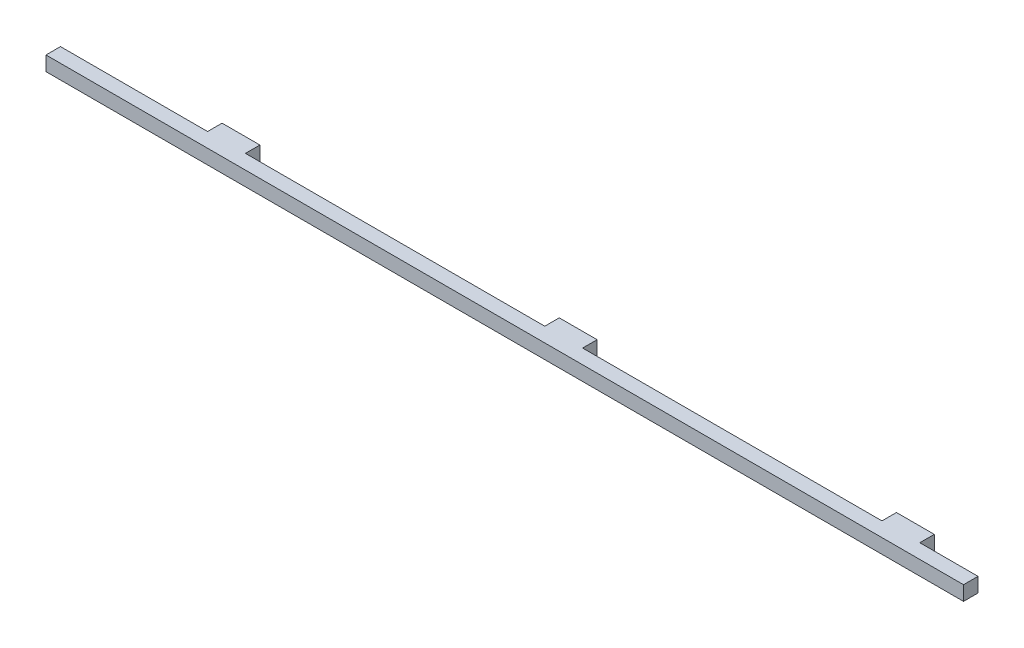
from build123d import *

# Parameters (mm, degrees)
EXTRUDE_1_DEPTH = 3


with BuildPart() as part:
    # Sketch 1 → Extrude 1 (new body)
    with BuildSketch(Plane(origin=(0, 0, 0), x_dir=(1, 0, 0), z_dir=(0, 1, 0))):
        Polygon((-134.190457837, 103.580258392), (-134.190457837, 100.580258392), (-122.140557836, 100.580258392), (-122.140557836, 97.580258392), (-312.140557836, 97.580258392), (-312.140557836, 100.580258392), (-281.679657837, 100.580258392), (-281.679657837, 103.580258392), (-273.841357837, 103.580258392), (-273.841357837, 100.580258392), (-211.854057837, 100.580258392), (-211.854057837, 103.580258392), (-204.015857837, 103.580258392), (-204.015857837, 100.580258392), (-142.028857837, 100.580258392), (-142.028857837, 103.580258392), align=None)
    extrude(amount=EXTRUDE_1_DEPTH)


solid = part.part
